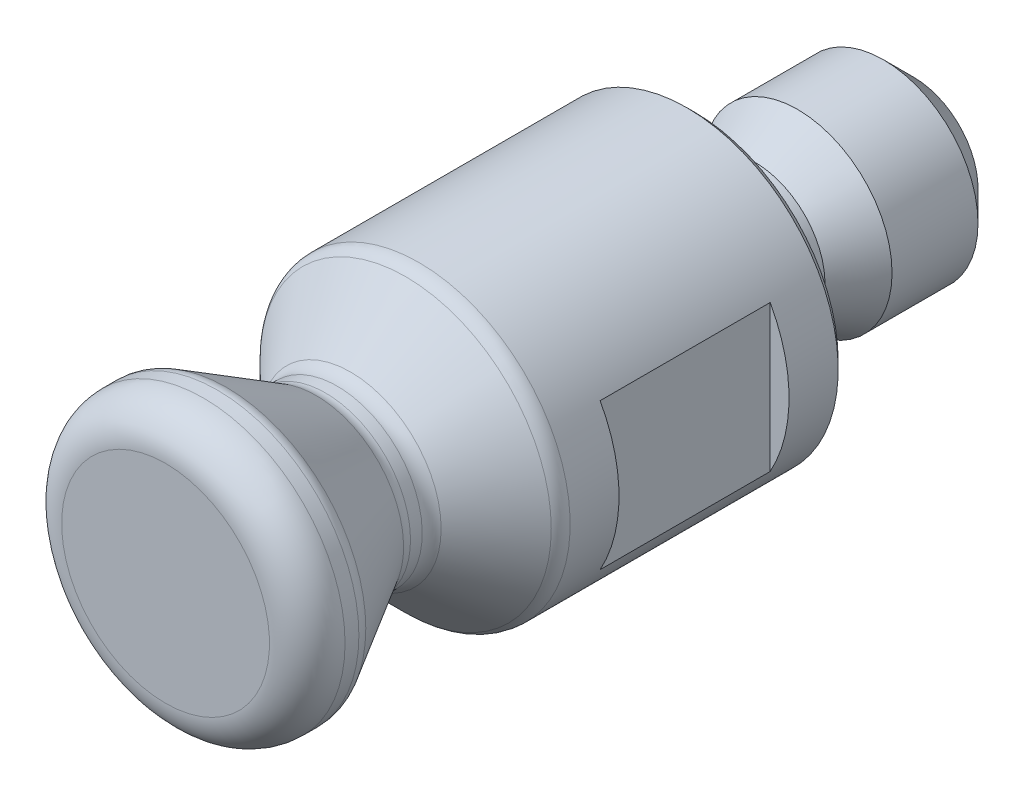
ISO-10303-21;
HEADER;
FILE_DESCRIPTION(('STEP AP214'),'2;1');
FILE_NAME('part.step','',(''),(''),'','','');
FILE_SCHEMA(('AUTOMOTIVE_DESIGN { 1 0 10303 214 1 1 1 1 }'));
ENDSEC;
DATA;
#1=APPLICATION_CONTEXT('core data for automotive mechanical design processes');
#2=APPLICATION_PROTOCOL_DEFINITION('international standard','automotive_design',2000,#1);
#3=PRODUCT_CONTEXT('',#1,'mechanical');
#4=PRODUCT('Part','Part','',(#3));
#5=PRODUCT_RELATED_PRODUCT_CATEGORY('part','',(#4));
#6=PRODUCT_DEFINITION_FORMATION('','',#4);
#7=PRODUCT_DEFINITION_CONTEXT('part definition',#1,'design');
#8=PRODUCT_DEFINITION('design','',#6,#7);
#9=PRODUCT_DEFINITION_SHAPE('','',#8);
#10=(LENGTH_UNIT() NAMED_UNIT(*) SI_UNIT(.MILLI.,.METRE.));
#11=(NAMED_UNIT(*) PLANE_ANGLE_UNIT() SI_UNIT($,.RADIAN.));
#12=(NAMED_UNIT(*) SI_UNIT($,.STERADIAN.) SOLID_ANGLE_UNIT());
#13=UNCERTAINTY_MEASURE_WITH_UNIT(LENGTH_MEASURE(1.E-05),#10,'distance_accuracy_value','');
#14=(GEOMETRIC_REPRESENTATION_CONTEXT(3) GLOBAL_UNCERTAINTY_ASSIGNED_CONTEXT((#13)) GLOBAL_UNIT_ASSIGNED_CONTEXT((#10,
#11,#12)) REPRESENTATION_CONTEXT('',''));
#15=CARTESIAN_POINT('',(0.,0.,0.));
#16=DIRECTION('',(0.,0.,1.));
#17=DIRECTION('',(1.,0.,0.));
#18=AXIS2_PLACEMENT_3D('',#15,#16,#17);
#19=CARTESIAN_POINT('',(2.5,0.,0.));
#20=DIRECTION('',(0.,0.,-1.));
#21=DIRECTION('',(0.,1.,0.));
#22=AXIS2_PLACEMENT_3D('',#19,#20,#21);
#23=PLANE('',#22);
#24=CARTESIAN_POINT('',(0.,0.,0.));
#25=DIRECTION('',(0.,0.,-1.));
#26=DIRECTION('',(0.,1.,0.));
#27=AXIS2_PLACEMENT_3D('',#24,#25,#26);
#28=CIRCLE('',#27,2.25);
#29=CARTESIAN_POINT('',(0.,2.25,0.));
#30=VERTEX_POINT('',#29);
#31=EDGE_CURVE('E101',#30,#30,#28,.F.);
#32=ORIENTED_EDGE('',*,*,#31,.T.);
#33=EDGE_LOOP('',(#32));
#34=FACE_BOUND('',#33,.T.);
#35=CARTESIAN_POINT('',(0.,0.,0.));
#36=DIRECTION('',(0.,0.,-1.));
#37=DIRECTION('',(0.,1.,0.));
#38=AXIS2_PLACEMENT_3D('',#35,#36,#37);
#39=CIRCLE('',#38,3.8);
#40=CARTESIAN_POINT('',(0.,3.8,0.));
#41=VERTEX_POINT('',#40);
#42=EDGE_CURVE('E98',#41,#41,#39,.T.);
#43=ORIENTED_EDGE('',*,*,#42,.T.);
#44=EDGE_LOOP('',(#43));
#45=FACE_BOUND('',#44,.T.);
#46=ADVANCED_FACE('F14',(#34,#45),#23,.T.);
#47=CARTESIAN_POINT('',(0.,0.,0.));
#48=DIRECTION('',(0.,0.,1.));
#49=DIRECTION('',(0.,-1.,0.));
#50=AXIS2_PLACEMENT_3D('',#47,#48,#49);
#51=CYLINDRICAL_SURFACE('',#50,4.);
#52=CARTESIAN_POINT('',(0.,0.,7.29289321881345));
#53=DIRECTION('',(0.,0.,-1.));
#54=DIRECTION('',(0.,1.,0.));
#55=AXIS2_PLACEMENT_3D('',#52,#53,#54);
#56=CIRCLE('',#55,4.);
#57=CARTESIAN_POINT('',(0.,4.00000000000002,7.29289321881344));
#58=VERTEX_POINT('',#57);
#59=EDGE_CURVE('E137',#58,#58,#56,.T.);
#60=ORIENTED_EDGE('',*,*,#59,.T.);
#61=EDGE_LOOP('',(#60));
#62=FACE_BOUND('',#61,.T.);
#63=CARTESIAN_POINT('',(0.,0.,6.));
#64=DIRECTION('',(0.,0.,1.));
#65=DIRECTION('',(0.,-1.,0.));
#66=AXIS2_PLACEMENT_3D('',#63,#64,#65);
#67=CIRCLE('',#66,4.);
#68=CARTESIAN_POINT('',(-3.5,-1.93649167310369,6.));
#69=VERTEX_POINT('',#68);
#70=CARTESIAN_POINT('',(-3.5,1.93649167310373,6.));
#71=VERTEX_POINT('',#70);
#72=EDGE_CURVE('E55',#69,#71,#67,.F.);
#73=ORIENTED_EDGE('',*,*,#72,.F.);
#74=DIRECTION('',(0.,0.,1.));
#75=VECTOR('',#74,1.);
#76=CARTESIAN_POINT('',(-3.5,-1.9364916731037,0.));
#77=LINE('',#76,#75);
#78=CARTESIAN_POINT('',(-3.5,-1.9364916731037,1.5));
#79=VERTEX_POINT('',#78);
#80=EDGE_CURVE('E59',#79,#69,#77,.T.);
#81=ORIENTED_EDGE('',*,*,#80,.F.);
#82=CARTESIAN_POINT('',(0.,0.,1.5));
#83=DIRECTION('',(0.,0.,-1.));
#84=DIRECTION('',(-1.,0.,0.));
#85=AXIS2_PLACEMENT_3D('',#82,#83,#84);
#86=CIRCLE('',#85,4.);
#87=CARTESIAN_POINT('',(-3.5,1.93649167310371,1.5));
#88=VERTEX_POINT('',#87);
#89=EDGE_CURVE('E72',#88,#79,#86,.F.);
#90=ORIENTED_EDGE('',*,*,#89,.F.);
#91=DIRECTION('',(0.,0.,1.));
#92=VECTOR('',#91,1.);
#93=CARTESIAN_POINT('',(-3.5,1.9364916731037,0.));
#94=LINE('',#93,#92);
#95=EDGE_CURVE('E60',#71,#88,#94,.F.);
#96=ORIENTED_EDGE('',*,*,#95,.F.);
#97=EDGE_LOOP('',(#73,#81,#90,#96));
#98=FACE_BOUND('',#97,.T.);
#99=CARTESIAN_POINT('',(0.,0.,6.));
#100=DIRECTION('',(0.,0.,1.));
#101=DIRECTION('',(0.,-1.,0.));
#102=AXIS2_PLACEMENT_3D('',#99,#100,#101);
#103=CIRCLE('',#102,4.);
#104=CARTESIAN_POINT('',(3.5,1.93649167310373,6.));
#105=VERTEX_POINT('',#104);
#106=CARTESIAN_POINT('',(3.5,-1.93649167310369,6.));
#107=VERTEX_POINT('',#106);
#108=EDGE_CURVE('E29',#105,#107,#103,.F.);
#109=ORIENTED_EDGE('',*,*,#108,.F.);
#110=DIRECTION('',(0.,0.,1.));
#111=VECTOR('',#110,1.);
#112=CARTESIAN_POINT('',(3.5,1.93649167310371,0.));
#113=LINE('',#112,#111);
#114=CARTESIAN_POINT('',(3.5,1.93649167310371,1.5));
#115=VERTEX_POINT('',#114);
#116=EDGE_CURVE('E109',#115,#105,#113,.T.);
#117=ORIENTED_EDGE('',*,*,#116,.F.);
#118=CARTESIAN_POINT('',(0.,0.,1.5));
#119=DIRECTION('',(0.,0.,-1.));
#120=DIRECTION('',(0.,1.,0.));
#121=AXIS2_PLACEMENT_3D('',#118,#119,#120);
#122=CIRCLE('',#121,4.);
#123=CARTESIAN_POINT('',(3.5,-1.9364916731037,1.5));
#124=VERTEX_POINT('',#123);
#125=EDGE_CURVE('E107',#124,#115,#122,.F.);
#126=ORIENTED_EDGE('',*,*,#125,.F.);
#127=DIRECTION('',(0.,0.,1.));
#128=VECTOR('',#127,1.);
#129=CARTESIAN_POINT('',(3.5,-1.93649167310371,0.));
#130=LINE('',#129,#128);
#131=EDGE_CURVE('E111',#107,#124,#130,.F.);
#132=ORIENTED_EDGE('',*,*,#131,.F.);
#133=EDGE_LOOP('',(#109,#117,#126,#132));
#134=FACE_BOUND('',#133,.T.);
#135=CARTESIAN_POINT('',(0.,0.,0.200000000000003));
#136=DIRECTION('',(0.,0.,-1.));
#137=DIRECTION('',(0.,1.,0.));
#138=AXIS2_PLACEMENT_3D('',#135,#136,#137);
#139=CIRCLE('',#138,4.);
#140=CARTESIAN_POINT('',(0.,4.,0.199999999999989));
#141=VERTEX_POINT('',#140);
#142=EDGE_CURVE('E95',#141,#141,#139,.F.);
#143=ORIENTED_EDGE('',*,*,#142,.T.);
#144=EDGE_LOOP('',(#143));
#145=FACE_BOUND('',#144,.T.);
#146=ADVANCED_FACE('F57',(#62,#98,#134,#145),#51,.T.);
#147=CARTESIAN_POINT('',(0.,0.,9.25));
#148=DIRECTION('',(0.,0.,-1.));
#149=DIRECTION('',(0.,1.,0.));
#150=AXIS2_PLACEMENT_3D('',#147,#148,#149);
#151=CONICAL_SURFACE('',#150,2.25,0.78539816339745);
#152=CARTESIAN_POINT('',(0.,0.,9.10355339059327));
#153=DIRECTION('',(0.,0.,-1.));
#154=DIRECTION('',(0.,1.,0.));
#155=AXIS2_PLACEMENT_3D('',#152,#153,#154);
#156=CIRCLE('',#155,2.39644660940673);
#157=CARTESIAN_POINT('',(0.,2.39644660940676,9.10355339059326));
#158=VERTEX_POINT('',#157);
#159=EDGE_CURVE('E134',#158,#158,#156,.T.);
#160=ORIENTED_EDGE('',*,*,#159,.T.);
#161=EDGE_LOOP('',(#160));
#162=FACE_BOUND('',#161,.T.);
#163=CARTESIAN_POINT('',(0.,0.,7.64644660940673));
#164=DIRECTION('',(0.,0.,1.));
#165=DIRECTION('',(0.,-1.,0.));
#166=AXIS2_PLACEMENT_3D('',#163,#164,#165);
#167=CIRCLE('',#166,3.85355339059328);
#168=CARTESIAN_POINT('',(0.,-3.85355339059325,7.64644660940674));
#169=VERTEX_POINT('',#168);
#170=EDGE_CURVE('E131',#169,#169,#167,.T.);
#171=ORIENTED_EDGE('',*,*,#170,.T.);
#172=EDGE_LOOP('',(#171));
#173=FACE_BOUND('',#172,.T.);
#174=ADVANCED_FACE('F162',(#162,#173),#151,.T.);
#175=CARTESIAN_POINT('',(0.,0.,0.));
#176=DIRECTION('',(0.,0.,1.));
#177=DIRECTION('',(0.,-1.,0.));
#178=AXIS2_PLACEMENT_3D('',#175,#176,#177);
#179=CYLINDRICAL_SURFACE('',#178,2.25);
#180=CARTESIAN_POINT('',(0.,0.,9.45710678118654));
#181=DIRECTION('',(0.,0.,1.));
#182=DIRECTION('',(0.,-1.,0.));
#183=AXIS2_PLACEMENT_3D('',#180,#181,#182);
#184=CIRCLE('',#183,2.25);
#185=CARTESIAN_POINT('',(0.,-2.24999999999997,9.45710678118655));
#186=VERTEX_POINT('',#185);
#187=EDGE_CURVE('E128',#186,#186,#184,.T.);
#188=ORIENTED_EDGE('',*,*,#187,.T.);
#189=EDGE_LOOP('',(#188));
#190=FACE_BOUND('',#189,.T.);
#191=CARTESIAN_POINT('',(0.,0.,9.76794919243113));
#192=DIRECTION('',(0.,0.,1.));
#193=DIRECTION('',(0.,-1.,0.));
#194=AXIS2_PLACEMENT_3D('',#191,#192,#193);
#195=CIRCLE('',#194,2.25);
#196=CARTESIAN_POINT('',(0.,-2.24999999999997,9.76794919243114));
#197=VERTEX_POINT('',#196);
#198=EDGE_CURVE('E119',#197,#197,#195,.F.);
#199=ORIENTED_EDGE('',*,*,#198,.T.);
#200=EDGE_LOOP('',(#199));
#201=FACE_BOUND('',#200,.T.);
#202=ADVANCED_FACE('F201',(#190,#201),#179,.T.);
#203=CARTESIAN_POINT('',(0.,0.,12.5));
#204=DIRECTION('',(0.,0.,1.));
#205=DIRECTION('',(0.,-1.,0.));
#206=AXIS2_PLACEMENT_3D('',#203,#204,#205);
#207=CONICAL_SURFACE('',#206,3.75,0.523598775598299);
#208=CARTESIAN_POINT('',(0.,0.,12.3839745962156));
#209=DIRECTION('',(0.,0.,-1.));
#210=DIRECTION('',(0.,1.,0.));
#211=AXIS2_PLACEMENT_3D('',#208,#209,#210);
#212=CIRCLE('',#211,3.68301270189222);
#213=CARTESIAN_POINT('',(0.,3.68301270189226,12.3839745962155));
#214=VERTEX_POINT('',#213);
#215=EDGE_CURVE('E125',#214,#214,#212,.T.);
#216=ORIENTED_EDGE('',*,*,#215,.T.);
#217=EDGE_LOOP('',(#216));
#218=FACE_BOUND('',#217,.T.);
#219=CARTESIAN_POINT('',(0.,0.,10.0179491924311));
#220=DIRECTION('',(0.,0.,1.));
#221=DIRECTION('',(0.,-1.,0.));
#222=AXIS2_PLACEMENT_3D('',#219,#220,#221);
#223=CIRCLE('',#222,2.31698729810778);
#224=CARTESIAN_POINT('',(0.,-2.31698729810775,10.0179491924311));
#225=VERTEX_POINT('',#224);
#226=EDGE_CURVE('E71',#225,#225,#223,.T.);
#227=ORIENTED_EDGE('',*,*,#226,.T.);
#228=EDGE_LOOP('',(#227));
#229=FACE_BOUND('',#228,.T.);
#230=ADVANCED_FACE('F204',(#218,#229),#207,.T.);
#231=CARTESIAN_POINT('',(0.,0.,0.));
#232=DIRECTION('',(0.,0.,1.));
#233=DIRECTION('',(0.,-1.,0.));
#234=AXIS2_PLACEMENT_3D('',#231,#232,#233);
#235=CYLINDRICAL_SURFACE('',#234,3.75);
#236=CARTESIAN_POINT('',(0.,0.,13.));
#237=DIRECTION('',(0.,0.,1.));
#238=DIRECTION('',(0.,-1.,0.));
#239=AXIS2_PLACEMENT_3D('',#236,#237,#238);
#240=CIRCLE('',#239,3.75);
#241=CARTESIAN_POINT('',(0.,-3.74999999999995,13.));
#242=VERTEX_POINT('',#241);
#243=EDGE_CURVE('E9',#242,#242,#240,.F.);
#244=ORIENTED_EDGE('',*,*,#243,.T.);
#245=EDGE_LOOP('',(#244));
#246=FACE_BOUND('',#245,.T.);
#247=CARTESIAN_POINT('',(0.,0.,12.6339745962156));
#248=DIRECTION('',(0.,0.,-1.));
#249=DIRECTION('',(0.,1.,0.));
#250=AXIS2_PLACEMENT_3D('',#247,#248,#249);
#251=CIRCLE('',#250,3.75);
#252=CARTESIAN_POINT('',(0.,3.75000000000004,12.6339745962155));
#253=VERTEX_POINT('',#252);
#254=EDGE_CURVE('E122',#253,#253,#251,.F.);
#255=ORIENTED_EDGE('',*,*,#254,.T.);
#256=EDGE_LOOP('',(#255));
#257=FACE_BOUND('',#256,.T.);
#258=ADVANCED_FACE('F211',(#246,#257),#235,.T.);
#259=CARTESIAN_POINT('',(3.75,0.,14.));
#260=DIRECTION('',(0.,0.,1.));
#261=DIRECTION('',(0.,-1.,0.));
#262=AXIS2_PLACEMENT_3D('',#259,#260,#261);
#263=PLANE('',#262);
#264=CARTESIAN_POINT('',(0.,0.,14.));
#265=DIRECTION('',(0.,0.,1.));
#266=DIRECTION('',(0.,-1.,0.));
#267=AXIS2_PLACEMENT_3D('',#264,#265,#266);
#268=CIRCLE('',#267,2.75);
#269=CARTESIAN_POINT('',(0.,-2.74999999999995,14.));
#270=VERTEX_POINT('',#269);
#271=EDGE_CURVE('E22',#270,#270,#268,.T.);
#272=ORIENTED_EDGE('',*,*,#271,.T.);
#273=EDGE_LOOP('',(#272));
#274=FACE_BOUND('',#273,.T.);
#275=ADVANCED_FACE('F142',(#274),#263,.T.);
#276=CARTESIAN_POINT('',(0.,0.,0.200000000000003));
#277=DIRECTION('',(0.,0.,1.));
#278=DIRECTION('',(0.,-1.,0.));
#279=AXIS2_PLACEMENT_3D('',#276,#277,#278);
#280=CONICAL_SURFACE('',#279,4.,0.785398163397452);
#281=ORIENTED_EDGE('',*,*,#42,.F.);
#282=EDGE_LOOP('',(#281));
#283=FACE_BOUND('',#282,.T.);
#284=ORIENTED_EDGE('',*,*,#142,.F.);
#285=EDGE_LOOP('',(#284));
#286=FACE_BOUND('',#285,.T.);
#287=ADVANCED_FACE('F174',(#283,#286),#280,.T.);
#288=CARTESIAN_POINT('',(0.,0.,-2.72583302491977));
#289=DIRECTION('',(0.,0.,-1.));
#290=DIRECTION('',(0.,1.,0.));
#291=AXIS2_PLACEMENT_3D('',#288,#289,#290);
#292=CONICAL_SURFACE('',#291,2.5,0.523598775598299);
#293=CARTESIAN_POINT('',(0.,0.,-1.6));
#294=DIRECTION('',(0.,0.,1.));
#295=DIRECTION('',(0.,-1.,0.));
#296=AXIS2_PLACEMENT_3D('',#293,#294,#295);
#297=CIRCLE('',#296,1.85);
#298=CARTESIAN_POINT('',(0.,-1.85000000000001,-1.59999999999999));
#299=VERTEX_POINT('',#298);
#300=EDGE_CURVE('E81',#299,#299,#297,.T.);
#301=ORIENTED_EDGE('',*,*,#300,.F.);
#302=EDGE_LOOP('',(#301));
#303=FACE_BOUND('',#302,.T.);
#304=CARTESIAN_POINT('',(0.,0.,-2.72583302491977));
#305=DIRECTION('',(0.,0.,1.));
#306=DIRECTION('',(0.,-1.,0.));
#307=AXIS2_PLACEMENT_3D('',#304,#305,#306);
#308=CIRCLE('',#307,2.5);
#309=CARTESIAN_POINT('',(0.,-2.50000000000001,-2.72583302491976));
#310=VERTEX_POINT('',#309);
#311=EDGE_CURVE('E86',#310,#310,#308,.T.);
#312=ORIENTED_EDGE('',*,*,#311,.T.);
#313=EDGE_LOOP('',(#312));
#314=FACE_BOUND('',#313,.T.);
#315=ADVANCED_FACE('F177',(#303,#314),#292,.T.);
#316=CARTESIAN_POINT('',(0.,0.,0.));
#317=DIRECTION('',(0.,0.,1.));
#318=DIRECTION('',(0.,-1.,0.));
#319=AXIS2_PLACEMENT_3D('',#316,#317,#318);
#320=CYLINDRICAL_SURFACE('',#319,1.85);
#321=CARTESIAN_POINT('',(0.,0.,-0.4));
#322=DIRECTION('',(0.,0.,-1.));
#323=DIRECTION('',(0.,1.,0.));
#324=AXIS2_PLACEMENT_3D('',#321,#322,#323);
#325=CIRCLE('',#324,1.85);
#326=CARTESIAN_POINT('',(0.,1.85,-0.400000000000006));
#327=VERTEX_POINT('',#326);
#328=EDGE_CURVE('E104',#327,#327,#325,.T.);
#329=ORIENTED_EDGE('',*,*,#328,.T.);
#330=EDGE_LOOP('',(#329));
#331=FACE_BOUND('',#330,.T.);
#332=ORIENTED_EDGE('',*,*,#300,.T.);
#333=EDGE_LOOP('',(#332));
#334=FACE_BOUND('',#333,.T.);
#335=ADVANCED_FACE('F276',(#331,#334),#320,.T.);
#336=CARTESIAN_POINT('',(2.5,0.,-5.8));
#337=DIRECTION('',(0.,0.,-1.));
#338=DIRECTION('',(0.,1.,0.));
#339=AXIS2_PLACEMENT_3D('',#336,#337,#338);
#340=PLANE('',#339);
#341=CARTESIAN_POINT('',(0.,0.,-5.8));
#342=DIRECTION('',(0.,0.,-1.));
#343=DIRECTION('',(0.,1.,0.));
#344=AXIS2_PLACEMENT_3D('',#341,#342,#343);
#345=CIRCLE('',#344,1.7);
#346=CARTESIAN_POINT('',(0.,1.69999999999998,-5.80000000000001));
#347=VERTEX_POINT('',#346);
#348=EDGE_CURVE('E92',#347,#347,#345,.T.);
#349=ORIENTED_EDGE('',*,*,#348,.T.);
#350=EDGE_LOOP('',(#349));
#351=FACE_BOUND('',#350,.T.);
#352=ADVANCED_FACE('F172',(#351),#340,.T.);
#353=CARTESIAN_POINT('',(0.,0.,-5.));
#354=DIRECTION('',(0.,0.,1.));
#355=DIRECTION('',(0.,-1.,0.));
#356=AXIS2_PLACEMENT_3D('',#353,#354,#355);
#357=CONICAL_SURFACE('',#356,2.5,0.78539816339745);
#358=ORIENTED_EDGE('',*,*,#348,.F.);
#359=EDGE_LOOP('',(#358));
#360=FACE_BOUND('',#359,.T.);
#361=CARTESIAN_POINT('',(0.,0.,-5.));
#362=DIRECTION('',(0.,0.,-1.));
#363=DIRECTION('',(0.,1.,0.));
#364=AXIS2_PLACEMENT_3D('',#361,#362,#363);
#365=CIRCLE('',#364,2.5);
#366=CARTESIAN_POINT('',(0.,2.49999999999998,-5.00000000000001));
#367=VERTEX_POINT('',#366);
#368=EDGE_CURVE('E89',#367,#367,#365,.F.);
#369=ORIENTED_EDGE('',*,*,#368,.F.);
#370=EDGE_LOOP('',(#369));
#371=FACE_BOUND('',#370,.T.);
#372=ADVANCED_FACE('F168',(#360,#371),#357,.T.);
#373=CARTESIAN_POINT('',(0.,0.,0.));
#374=DIRECTION('',(0.,0.,1.));
#375=DIRECTION('',(0.,-1.,0.));
#376=AXIS2_PLACEMENT_3D('',#373,#374,#375);
#377=CYLINDRICAL_SURFACE('',#376,2.5);
#378=ORIENTED_EDGE('',*,*,#311,.F.);
#379=EDGE_LOOP('',(#378));
#380=FACE_BOUND('',#379,.T.);
#381=ORIENTED_EDGE('',*,*,#368,.T.);
#382=EDGE_LOOP('',(#381));
#383=FACE_BOUND('',#382,.T.);
#384=ADVANCED_FACE('F171',(#380,#383),#377,.T.);
#385=CARTESIAN_POINT('',(0.,0.,-0.4));
#386=DIRECTION('',(0.,0.,-1.));
#387=DIRECTION('',(0.,1.,0.));
#388=AXIS2_PLACEMENT_3D('',#385,#386,#387);
#389=TOROIDAL_SURFACE('',#388,2.25,0.4);
#390=ORIENTED_EDGE('',*,*,#328,.F.);
#391=EDGE_LOOP('',(#390));
#392=FACE_BOUND('',#391,.T.);
#393=ORIENTED_EDGE('',*,*,#31,.F.);
#394=EDGE_LOOP('',(#393));
#395=FACE_BOUND('',#394,.T.);
#396=ADVANCED_FACE('F179',(#392,#395),#389,.F.);
#397=CARTESIAN_POINT('',(4.,-5.,6.));
#398=DIRECTION('',(0.,0.,1.));
#399=DIRECTION('',(0.,-1.,0.));
#400=AXIS2_PLACEMENT_3D('',#397,#398,#399);
#401=PLANE('',#400);
#402=DIRECTION('',(0.,1.,0.));
#403=VECTOR('',#402,1.);
#404=CARTESIAN_POINT('',(3.5,-5.,6.));
#405=LINE('',#404,#403);
#406=EDGE_CURVE('E79',#107,#105,#405,.T.);
#407=ORIENTED_EDGE('',*,*,#406,.T.);
#408=ORIENTED_EDGE('',*,*,#108,.T.);
#409=EDGE_LOOP('',(#407,#408));
#410=FACE_BOUND('',#409,.T.);
#411=ADVANCED_FACE('F182',(#410),#401,.F.);
#412=CARTESIAN_POINT('',(3.5,-5.,1.5));
#413=DIRECTION('',(-1.,0.,0.));
#414=DIRECTION('',(0.,0.,1.));
#415=AXIS2_PLACEMENT_3D('',#412,#413,#414);
#416=PLANE('',#415);
#417=ORIENTED_EDGE('',*,*,#131,.T.);
#418=DIRECTION('',(0.,1.,0.));
#419=VECTOR('',#418,1.);
#420=CARTESIAN_POINT('',(3.5,-5.,1.5));
#421=LINE('',#420,#419);
#422=EDGE_CURVE('E76',#124,#115,#421,.T.);
#423=ORIENTED_EDGE('',*,*,#422,.T.);
#424=ORIENTED_EDGE('',*,*,#116,.T.);
#425=ORIENTED_EDGE('',*,*,#406,.F.);
#426=EDGE_LOOP('',(#417,#423,#424,#425));
#427=FACE_BOUND('',#426,.T.);
#428=ADVANCED_FACE('F322',(#427),#416,.F.);
#429=CARTESIAN_POINT('',(4.,-5.,1.5));
#430=DIRECTION('',(0.,0.,-1.));
#431=DIRECTION('',(0.,1.,0.));
#432=AXIS2_PLACEMENT_3D('',#429,#430,#431);
#433=PLANE('',#432);
#434=ORIENTED_EDGE('',*,*,#422,.F.);
#435=ORIENTED_EDGE('',*,*,#125,.T.);
#436=EDGE_LOOP('',(#434,#435));
#437=FACE_BOUND('',#436,.T.);
#438=ADVANCED_FACE('F330',(#437),#433,.F.);
#439=CARTESIAN_POINT('',(-4.,-5.,1.5));
#440=DIRECTION('',(0.,0.,-1.));
#441=DIRECTION('',(-1.,0.,0.));
#442=AXIS2_PLACEMENT_3D('',#439,#440,#441);
#443=PLANE('',#442);
#444=ORIENTED_EDGE('',*,*,#89,.T.);
#445=DIRECTION('',(0.,1.,0.));
#446=VECTOR('',#445,1.);
#447=CARTESIAN_POINT('',(-3.5,-5.,1.5));
#448=LINE('',#447,#446);
#449=EDGE_CURVE('E70',#79,#88,#448,.T.);
#450=ORIENTED_EDGE('',*,*,#449,.T.);
#451=EDGE_LOOP('',(#444,#450));
#452=FACE_BOUND('',#451,.T.);
#453=ADVANCED_FACE('F339',(#452),#443,.F.);
#454=CARTESIAN_POINT('',(-3.5,-5.,1.5));
#455=DIRECTION('',(1.,0.,0.));
#456=DIRECTION('',(0.,0.,-1.));
#457=AXIS2_PLACEMENT_3D('',#454,#455,#456);
#458=PLANE('',#457);
#459=ORIENTED_EDGE('',*,*,#95,.T.);
#460=ORIENTED_EDGE('',*,*,#449,.F.);
#461=ORIENTED_EDGE('',*,*,#80,.T.);
#462=DIRECTION('',(0.,1.,0.));
#463=VECTOR('',#462,1.);
#464=CARTESIAN_POINT('',(-3.5,-5.,6.));
#465=LINE('',#464,#463);
#466=EDGE_CURVE('E68',#69,#71,#465,.T.);
#467=ORIENTED_EDGE('',*,*,#466,.T.);
#468=EDGE_LOOP('',(#459,#460,#461,#467));
#469=FACE_BOUND('',#468,.T.);
#470=ADVANCED_FACE('F67',(#469),#458,.F.);
#471=CARTESIAN_POINT('',(-4.,-5.,6.));
#472=DIRECTION('',(0.,0.,1.));
#473=DIRECTION('',(0.,-1.,0.));
#474=AXIS2_PLACEMENT_3D('',#471,#472,#473);
#475=PLANE('',#474);
#476=ORIENTED_EDGE('',*,*,#466,.F.);
#477=ORIENTED_EDGE('',*,*,#72,.T.);
#478=EDGE_LOOP('',(#476,#477));
#479=FACE_BOUND('',#478,.T.);
#480=ADVANCED_FACE('F74',(#479),#475,.F.);
#481=CARTESIAN_POINT('',(0.,0.,9.76794919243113));
#482=DIRECTION('',(0.,0.,1.));
#483=DIRECTION('',(0.,-1.,0.));
#484=AXIS2_PLACEMENT_3D('',#481,#482,#483);
#485=TOROIDAL_SURFACE('',#484,2.75,0.5);
#486=ORIENTED_EDGE('',*,*,#198,.F.);
#487=EDGE_LOOP('',(#486));
#488=FACE_BOUND('',#487,.T.);
#489=ORIENTED_EDGE('',*,*,#226,.F.);
#490=EDGE_LOOP('',(#489));
#491=FACE_BOUND('',#490,.T.);
#492=ADVANCED_FACE('F184',(#488,#491),#485,.F.);
#493=CARTESIAN_POINT('',(0.,0.,12.6339745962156));
#494=DIRECTION('',(0.,0.,-1.));
#495=DIRECTION('',(0.,1.,0.));
#496=AXIS2_PLACEMENT_3D('',#493,#494,#495);
#497=TOROIDAL_SURFACE('',#496,3.25,0.5);
#498=ORIENTED_EDGE('',*,*,#215,.F.);
#499=EDGE_LOOP('',(#498));
#500=FACE_BOUND('',#499,.T.);
#501=ORIENTED_EDGE('',*,*,#254,.F.);
#502=EDGE_LOOP('',(#501));
#503=FACE_BOUND('',#502,.T.);
#504=ADVANCED_FACE('F187',(#500,#503),#497,.T.);
#505=CARTESIAN_POINT('',(0.,0.,9.45710678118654));
#506=DIRECTION('',(0.,0.,1.));
#507=DIRECTION('',(0.,-1.,0.));
#508=AXIS2_PLACEMENT_3D('',#505,#506,#507);
#509=TOROIDAL_SURFACE('',#508,2.75,0.5);
#510=ORIENTED_EDGE('',*,*,#159,.F.);
#511=EDGE_LOOP('',(#510));
#512=FACE_BOUND('',#511,.T.);
#513=ORIENTED_EDGE('',*,*,#187,.F.);
#514=EDGE_LOOP('',(#513));
#515=FACE_BOUND('',#514,.T.);
#516=ADVANCED_FACE('F152',(#512,#515),#509,.F.);
#517=CARTESIAN_POINT('',(0.,0.,7.29289321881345));
#518=DIRECTION('',(0.,0.,-1.));
#519=DIRECTION('',(0.,1.,0.));
#520=AXIS2_PLACEMENT_3D('',#517,#518,#519);
#521=TOROIDAL_SURFACE('',#520,3.5,0.5);
#522=ORIENTED_EDGE('',*,*,#59,.F.);
#523=EDGE_LOOP('',(#522));
#524=FACE_BOUND('',#523,.T.);
#525=ORIENTED_EDGE('',*,*,#170,.F.);
#526=EDGE_LOOP('',(#525));
#527=FACE_BOUND('',#526,.T.);
#528=ADVANCED_FACE('F145',(#524,#527),#521,.T.);
#529=CARTESIAN_POINT('',(0.,0.,13.));
#530=DIRECTION('',(0.,0.,1.));
#531=DIRECTION('',(0.,-1.,0.));
#532=AXIS2_PLACEMENT_3D('',#529,#530,#531);
#533=TOROIDAL_SURFACE('',#532,2.75,1.);
#534=ORIENTED_EDGE('',*,*,#243,.F.);
#535=EDGE_LOOP('',(#534));
#536=FACE_BOUND('',#535,.T.);
#537=ORIENTED_EDGE('',*,*,#271,.F.);
#538=EDGE_LOOP('',(#537));
#539=FACE_BOUND('',#538,.T.);
#540=ADVANCED_FACE('F16',(#536,#539),#533,.T.);
#541=CLOSED_SHELL('',(#46,#146,#174,#202,#230,#258,#275,#287,#315,#335,#352,#372,#384,#396,#411,
#428,#438,#453,#470,#480,#492,#504,#516,#528,#540));
#542=MANIFOLD_SOLID_BREP('B1',#541);
#543=ADVANCED_BREP_SHAPE_REPRESENTATION('',(#18,#542),#14);
#544=SHAPE_DEFINITION_REPRESENTATION(#9,#543);
ENDSEC;
END-ISO-10303-21;
